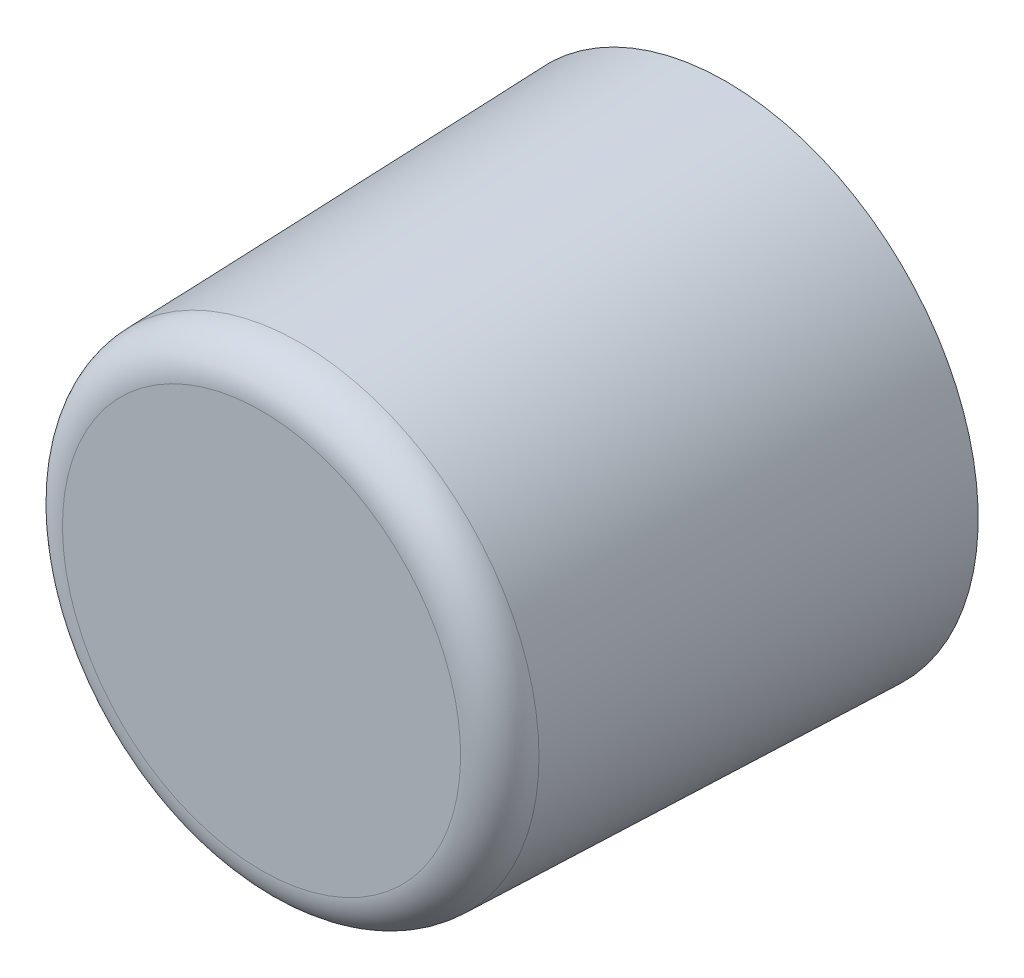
ISO-10303-21;
HEADER;
FILE_DESCRIPTION(('STEP AP214'),'2;1');
FILE_NAME('part.step','',(''),(''),'','','');
FILE_SCHEMA(('AUTOMOTIVE_DESIGN { 1 0 10303 214 1 1 1 1 }'));
ENDSEC;
DATA;
#1=APPLICATION_CONTEXT('core data for automotive mechanical design processes');
#2=APPLICATION_PROTOCOL_DEFINITION('international standard','automotive_design',2000,#1);
#3=PRODUCT_CONTEXT('',#1,'mechanical');
#4=PRODUCT('Part','Part','',(#3));
#5=PRODUCT_RELATED_PRODUCT_CATEGORY('part','',(#4));
#6=PRODUCT_DEFINITION_FORMATION('','',#4);
#7=PRODUCT_DEFINITION_CONTEXT('part definition',#1,'design');
#8=PRODUCT_DEFINITION('design','',#6,#7);
#9=PRODUCT_DEFINITION_SHAPE('','',#8);
#10=(LENGTH_UNIT() NAMED_UNIT(*) SI_UNIT(.MILLI.,.METRE.));
#11=(NAMED_UNIT(*) PLANE_ANGLE_UNIT() SI_UNIT($,.RADIAN.));
#12=(NAMED_UNIT(*) SI_UNIT($,.STERADIAN.) SOLID_ANGLE_UNIT());
#13=UNCERTAINTY_MEASURE_WITH_UNIT(LENGTH_MEASURE(1.E-05),#10,'distance_accuracy_value','');
#14=(GEOMETRIC_REPRESENTATION_CONTEXT(3) GLOBAL_UNCERTAINTY_ASSIGNED_CONTEXT((#13)) GLOBAL_UNIT_ASSIGNED_CONTEXT((#10,
#11,#12)) REPRESENTATION_CONTEXT('',''));
#15=CARTESIAN_POINT('',(0.,0.,0.));
#16=DIRECTION('',(0.,0.,1.));
#17=DIRECTION('',(1.,0.,0.));
#18=AXIS2_PLACEMENT_3D('',#15,#16,#17);
#19=CARTESIAN_POINT('',(0.,0.,35.));
#20=DIRECTION('',(0.,0.,1.));
#21=DIRECTION('',(0.,-1.,0.));
#22=AXIS2_PLACEMENT_3D('',#19,#20,#21);
#23=CYLINDRICAL_SURFACE('',#22,17.1);
#24=CARTESIAN_POINT('',(0.,0.,0.));
#25=DIRECTION('',(0.,0.,1.));
#26=DIRECTION('',(0.,-1.,0.));
#27=AXIS2_PLACEMENT_3D('',#24,#25,#26);
#28=CIRCLE('',#27,17.1);
#29=CARTESIAN_POINT('',(0.,-17.1,0.));
#30=VERTEX_POINT('',#29);
#31=EDGE_CURVE('E27',#30,#30,#28,.T.);
#32=ORIENTED_EDGE('',*,*,#31,.F.);
#33=EDGE_LOOP('',(#32));
#34=FACE_BOUND('',#33,.T.);
#35=CARTESIAN_POINT('',(0.,0.,0.0500000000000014));
#36=DIRECTION('',(0.,0.,1.));
#37=DIRECTION('',(0.,-1.,0.));
#38=AXIS2_PLACEMENT_3D('',#35,#36,#37);
#39=CIRCLE('',#38,17.1);
#40=CARTESIAN_POINT('',(0.,-17.1,0.0500000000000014));
#41=VERTEX_POINT('',#40);
#42=EDGE_CURVE('E44',#41,#41,#39,.T.);
#43=ORIENTED_EDGE('',*,*,#42,.T.);
#44=EDGE_LOOP('',(#43));
#45=FACE_BOUND('',#44,.T.);
#46=ADVANCED_FACE('F12',(#34,#45),#23,.F.);
#47=CARTESIAN_POINT('',(17.1,0.,0.));
#48=DIRECTION('',(0.,0.,1.));
#49=DIRECTION('',(0.,-1.,0.));
#50=AXIS2_PLACEMENT_3D('',#47,#48,#49);
#51=PLANE('',#50);
#52=CARTESIAN_POINT('',(0.,0.,0.));
#53=DIRECTION('',(0.,0.,1.));
#54=DIRECTION('',(0.,-1.,0.));
#55=AXIS2_PLACEMENT_3D('',#52,#53,#54);
#56=CIRCLE('',#55,19.);
#57=CARTESIAN_POINT('',(0.,-19.,0.));
#58=VERTEX_POINT('',#57);
#59=EDGE_CURVE('E32',#58,#58,#56,.T.);
#60=ORIENTED_EDGE('',*,*,#59,.F.);
#61=EDGE_LOOP('',(#60));
#62=FACE_BOUND('',#61,.T.);
#63=ORIENTED_EDGE('',*,*,#31,.T.);
#64=EDGE_LOOP('',(#63));
#65=FACE_BOUND('',#64,.T.);
#66=ADVANCED_FACE('F72',(#62,#65),#51,.F.);
#67=CARTESIAN_POINT('',(0.,0.,0.));
#68=DIRECTION('',(0.,0.,-1.));
#69=DIRECTION('',(0.,1.,0.));
#70=AXIS2_PLACEMENT_3D('',#67,#68,#69);
#71=CONICAL_SURFACE('',#70,19.,0.0311942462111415);
#72=CARTESIAN_POINT('',(0.,0.,32.0935675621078));
#73=DIRECTION('',(0.,0.,1.));
#74=DIRECTION('',(0.,-1.,0.));
#75=AXIS2_PLACEMENT_3D('',#72,#73,#74);
#76=CIRCLE('',#75,17.9985404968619);
#77=CARTESIAN_POINT('',(0.,-17.9985404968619,32.0935675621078));
#78=VERTEX_POINT('',#77);
#79=EDGE_CURVE('E35',#78,#78,#76,.T.);
#80=ORIENTED_EDGE('',*,*,#79,.F.);
#81=EDGE_LOOP('',(#80));
#82=FACE_BOUND('',#81,.T.);
#83=ORIENTED_EDGE('',*,*,#59,.T.);
#84=EDGE_LOOP('',(#83));
#85=FACE_BOUND('',#84,.T.);
#86=ADVANCED_FACE('F77',(#82,#85),#71,.T.);
#87=CARTESIAN_POINT('',(0.,0.,32.));
#88=DIRECTION('',(0.,0.,1.));
#89=DIRECTION('',(0.,-1.,0.));
#90=AXIS2_PLACEMENT_3D('',#87,#88,#89);
#91=TOROIDAL_SURFACE('',#90,15.,3.);
#92=ORIENTED_EDGE('',*,*,#79,.T.);
#93=EDGE_LOOP('',(#92));
#94=FACE_BOUND('',#93,.T.);
#95=CARTESIAN_POINT('',(0.,0.,35.));
#96=DIRECTION('',(0.,0.,1.));
#97=DIRECTION('',(0.,-1.,0.));
#98=AXIS2_PLACEMENT_3D('',#95,#96,#97);
#99=CIRCLE('',#98,15.);
#100=CARTESIAN_POINT('',(0.,-15.,35.));
#101=VERTEX_POINT('',#100);
#102=EDGE_CURVE('E38',#101,#101,#99,.T.);
#103=ORIENTED_EDGE('',*,*,#102,.F.);
#104=EDGE_LOOP('',(#103));
#105=FACE_BOUND('',#104,.T.);
#106=ADVANCED_FACE('F84',(#94,#105),#91,.T.);
#107=CARTESIAN_POINT('',(15.,0.,35.));
#108=DIRECTION('',(0.,0.,-1.));
#109=DIRECTION('',(0.,1.,0.));
#110=AXIS2_PLACEMENT_3D('',#107,#108,#109);
#111=PLANE('',#110);
#112=ORIENTED_EDGE('',*,*,#102,.T.);
#113=EDGE_LOOP('',(#112));
#114=FACE_BOUND('',#113,.T.);
#115=ADVANCED_FACE('F59',(#114),#111,.F.);
#116=CARTESIAN_POINT('',(0.,0.,0.));
#117=DIRECTION('',(0.,0.,1.));
#118=DIRECTION('',(0.,-1.,0.));
#119=AXIS2_PLACEMENT_3D('',#116,#117,#118);
#120=PLANE('',#119);
#121=CARTESIAN_POINT('',(0.,0.,0.));
#122=DIRECTION('',(0.,0.,1.));
#123=DIRECTION('',(0.,-1.,0.));
#124=AXIS2_PLACEMENT_3D('',#121,#122,#123);
#125=CIRCLE('',#124,17.05);
#126=CARTESIAN_POINT('',(0.,-17.05,0.));
#127=VERTEX_POINT('',#126);
#128=EDGE_CURVE('E41',#127,#127,#125,.T.);
#129=ORIENTED_EDGE('',*,*,#128,.F.);
#130=EDGE_LOOP('',(#129));
#131=FACE_BOUND('',#130,.T.);
#132=CARTESIAN_POINT('',(0.,0.,0.));
#133=DIRECTION('',(0.,0.,1.));
#134=DIRECTION('',(0.,-1.,0.));
#135=AXIS2_PLACEMENT_3D('',#132,#133,#134);
#136=CIRCLE('',#135,4.);
#137=CARTESIAN_POINT('',(0.,-4.,0.));
#138=VERTEX_POINT('',#137);
#139=EDGE_CURVE('E23',#138,#138,#136,.T.);
#140=ORIENTED_EDGE('',*,*,#139,.T.);
#141=EDGE_LOOP('',(#140));
#142=FACE_BOUND('',#141,.T.);
#143=ADVANCED_FACE('F53',(#131,#142),#120,.F.);
#144=CARTESIAN_POINT('',(0.,0.,0.));
#145=DIRECTION('',(0.,0.,1.));
#146=DIRECTION('',(0.,-1.,0.));
#147=AXIS2_PLACEMENT_3D('',#144,#145,#146);
#148=CONICAL_SURFACE('',#147,17.05,0.785398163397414);
#149=ORIENTED_EDGE('',*,*,#42,.F.);
#150=EDGE_LOOP('',(#149));
#151=FACE_BOUND('',#150,.T.);
#152=ORIENTED_EDGE('',*,*,#128,.T.);
#153=EDGE_LOOP('',(#152));
#154=FACE_BOUND('',#153,.T.);
#155=ADVANCED_FACE('F49',(#151,#154),#148,.T.);
#156=CARTESIAN_POINT('',(0.,0.,35.));
#157=DIRECTION('',(0.,0.,1.));
#158=DIRECTION('',(0.,-1.,0.));
#159=AXIS2_PLACEMENT_3D('',#156,#157,#158);
#160=CYLINDRICAL_SURFACE('',#159,4.);
#161=CARTESIAN_POINT('',(0.,0.,-8.8));
#162=DIRECTION('',(0.,0.,1.));
#163=DIRECTION('',(0.,-1.,0.));
#164=AXIS2_PLACEMENT_3D('',#161,#162,#163);
#165=CIRCLE('',#164,4.);
#166=CARTESIAN_POINT('',(0.,-4.,-8.8));
#167=VERTEX_POINT('',#166);
#168=EDGE_CURVE('E8',#167,#167,#165,.T.);
#169=ORIENTED_EDGE('',*,*,#168,.T.);
#170=EDGE_LOOP('',(#169));
#171=FACE_BOUND('',#170,.T.);
#172=ORIENTED_EDGE('',*,*,#139,.F.);
#173=EDGE_LOOP('',(#172));
#174=FACE_BOUND('',#173,.T.);
#175=ADVANCED_FACE('F52',(#171,#174),#160,.T.);
#176=CARTESIAN_POINT('',(0.,0.,-10.));
#177=DIRECTION('',(0.,0.,1.));
#178=DIRECTION('',(0.,-1.,0.));
#179=AXIS2_PLACEMENT_3D('',#176,#177,#178);
#180=PLANE('',#179);
#181=CARTESIAN_POINT('',(0.,0.,-10.));
#182=DIRECTION('',(0.,0.,1.));
#183=DIRECTION('',(0.,-1.,0.));
#184=AXIS2_PLACEMENT_3D('',#181,#182,#183);
#185=CIRCLE('',#184,2.8);
#186=CARTESIAN_POINT('',(0.,-2.8,-10.));
#187=VERTEX_POINT('',#186);
#188=EDGE_CURVE('E19',#187,#187,#185,.F.);
#189=ORIENTED_EDGE('',*,*,#188,.T.);
#190=EDGE_LOOP('',(#189));
#191=FACE_BOUND('',#190,.T.);
#192=ADVANCED_FACE('F64',(#191),#180,.F.);
#193=CARTESIAN_POINT('',(0.,0.,-10.));
#194=DIRECTION('',(0.,0.,1.));
#195=DIRECTION('',(0.,-1.,0.));
#196=AXIS2_PLACEMENT_3D('',#193,#194,#195);
#197=CONICAL_SURFACE('',#196,2.8,0.785398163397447);
#198=ORIENTED_EDGE('',*,*,#168,.F.);
#199=EDGE_LOOP('',(#198));
#200=FACE_BOUND('',#199,.T.);
#201=ORIENTED_EDGE('',*,*,#188,.F.);
#202=EDGE_LOOP('',(#201));
#203=FACE_BOUND('',#202,.T.);
#204=ADVANCED_FACE('F14',(#200,#203),#197,.T.);
#205=CLOSED_SHELL('',(#46,#66,#86,#106,#115,#143,#155,#175,#192,#204));
#206=MANIFOLD_SOLID_BREP('B1',#205);
#207=ADVANCED_BREP_SHAPE_REPRESENTATION('',(#18,#206),#14);
#208=SHAPE_DEFINITION_REPRESENTATION(#9,#207);
ENDSEC;
END-ISO-10303-21;
